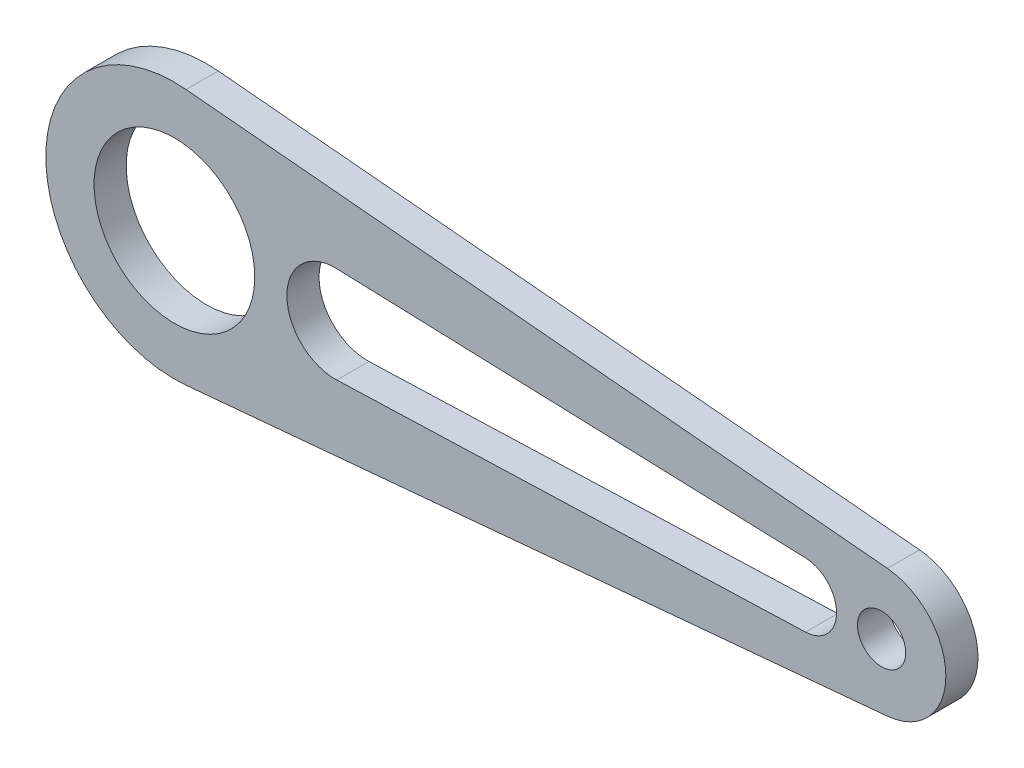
from build123d import *

# Parameters (mm, degrees)
SKETCH1_R      = 7.9375
SKETCH1_R_2    = 2.38125
EXTRUDE1_DEPTH = 1.5875


with BuildPart() as part:
    # Sketch1 → Extrude1 (new, symmetric)
    with BuildSketch(Plane.XY):
        with BuildLine():
            Line((1.154545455, 12.647411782), (70.427272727, 6.323705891))
            ThreePointArc((70.427272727, 6.323705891), (76.2, 0), (70.427272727, -6.323705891))
            Line((70.427272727, -6.323705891), (1.154545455, -12.647411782))
            ThreePointArc((1.154545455, -12.647411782), (-12.7, 0), (1.154545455, 12.647411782))
        make_face()
        Circle(SKETCH1_R, mode=Mode.SUBTRACT)
        with Locations((69.85, 0)):
            Circle(SKETCH1_R_2, mode=Mode.SUBTRACT)
        with BuildLine():
            Line((62.338732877, 3.173137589), (16.038099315, 4.759706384))
            ThreePointArc((16.038099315, 4.759706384), (11.1125, 0), (16.038099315, -4.759706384))
            Line((16.038099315, -4.759706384), (62.338732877, -3.173137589))
            ThreePointArc((62.338732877, -3.173137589), (65.405, 0), (62.338732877, 3.173137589))
        make_face(mode=Mode.SUBTRACT)
    extrude(amount=EXTRUDE1_DEPTH, both=True)


solid = part.part
